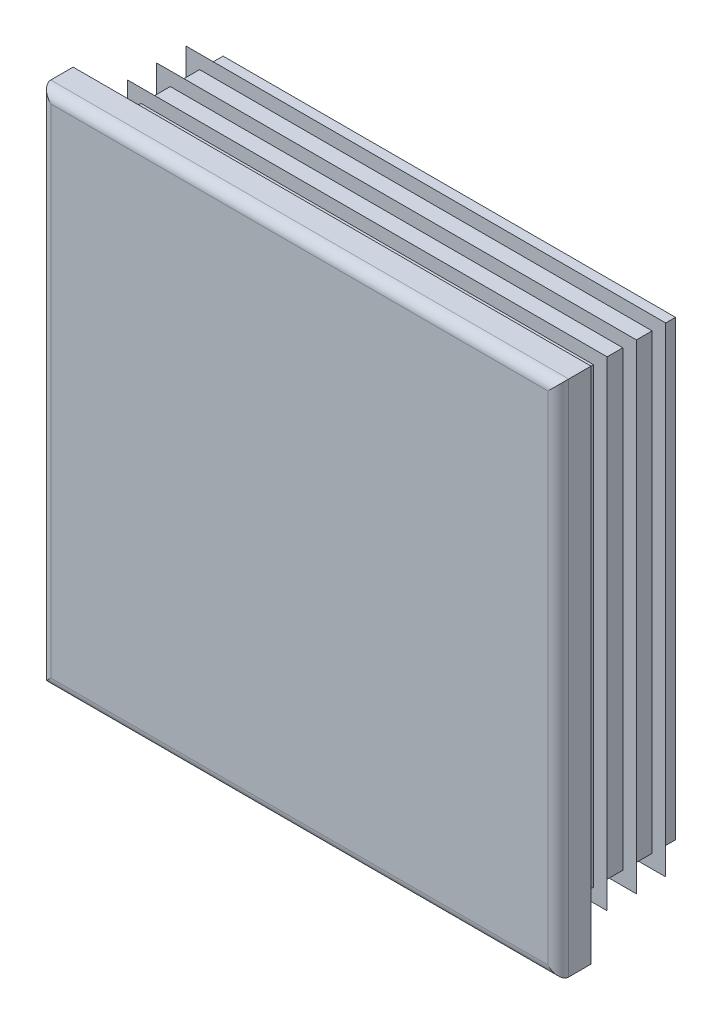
ISO-10303-21;
HEADER;
FILE_DESCRIPTION(('STEP AP214'),'2;1');
FILE_NAME('part.step','',(''),(''),'','','');
FILE_SCHEMA(('AUTOMOTIVE_DESIGN { 1 0 10303 214 1 1 1 1 }'));
ENDSEC;
DATA;
#1=APPLICATION_CONTEXT('core data for automotive mechanical design processes');
#2=APPLICATION_PROTOCOL_DEFINITION('international standard','automotive_design',2000,#1);
#3=PRODUCT_CONTEXT('',#1,'mechanical');
#4=PRODUCT('Part','Part','',(#3));
#5=PRODUCT_RELATED_PRODUCT_CATEGORY('part','',(#4));
#6=PRODUCT_DEFINITION_FORMATION('','',#4);
#7=PRODUCT_DEFINITION_CONTEXT('part definition',#1,'design');
#8=PRODUCT_DEFINITION('design','',#6,#7);
#9=PRODUCT_DEFINITION_SHAPE('','',#8);
#10=(LENGTH_UNIT() NAMED_UNIT(*) SI_UNIT(.MILLI.,.METRE.));
#11=(NAMED_UNIT(*) PLANE_ANGLE_UNIT() SI_UNIT($,.RADIAN.));
#12=(NAMED_UNIT(*) SI_UNIT($,.STERADIAN.) SOLID_ANGLE_UNIT());
#13=UNCERTAINTY_MEASURE_WITH_UNIT(LENGTH_MEASURE(1.E-05),#10,'distance_accuracy_value','');
#14=(GEOMETRIC_REPRESENTATION_CONTEXT(3) GLOBAL_UNCERTAINTY_ASSIGNED_CONTEXT((#13)) GLOBAL_UNIT_ASSIGNED_CONTEXT((#10,
#11,#12)) REPRESENTATION_CONTEXT('',''));
#15=CARTESIAN_POINT('',(0.,0.,0.));
#16=DIRECTION('',(0.,0.,1.));
#17=DIRECTION('',(1.,0.,0.));
#18=AXIS2_PLACEMENT_3D('',#15,#16,#17);
#19=CARTESIAN_POINT('',(45.6,-47.5,6.));
#20=DIRECTION('',(0.,0.,-1.));
#21=DIRECTION('',(0.,1.,0.));
#22=AXIS2_PLACEMENT_3D('',#19,#20,#21);
#23=PLANE('',#22);
#24=DIRECTION('',(0.,1.,0.));
#25=VECTOR('',#24,1.);
#26=CARTESIAN_POINT('',(-45.6,-47.5,6.));
#27=LINE('',#26,#25);
#28=CARTESIAN_POINT('',(-45.6,-45.6,6.));
#29=VERTEX_POINT('',#28);
#30=CARTESIAN_POINT('',(-45.6,45.6,6.));
#31=VERTEX_POINT('',#30);
#32=EDGE_CURVE('E262',#29,#31,#27,.T.);
#33=ORIENTED_EDGE('',*,*,#32,.F.);
#34=DIRECTION('',(-1.,0.,0.));
#35=VECTOR('',#34,1.);
#36=CARTESIAN_POINT('',(47.5,-45.6,6.));
#37=LINE('',#36,#35);
#38=CARTESIAN_POINT('',(45.6,-45.6,6.));
#39=VERTEX_POINT('',#38);
#40=EDGE_CURVE('E432',#39,#29,#37,.T.);
#41=ORIENTED_EDGE('',*,*,#40,.F.);
#42=DIRECTION('',(0.,1.,0.));
#43=VECTOR('',#42,1.);
#44=CARTESIAN_POINT('',(45.6,-47.5,6.));
#45=LINE('',#44,#43);
#46=CARTESIAN_POINT('',(45.6,45.6,6.));
#47=VERTEX_POINT('',#46);
#48=EDGE_CURVE('E257',#39,#47,#45,.T.);
#49=ORIENTED_EDGE('',*,*,#48,.T.);
#50=DIRECTION('',(-1.,0.,0.));
#51=VECTOR('',#50,1.);
#52=CARTESIAN_POINT('',(47.5,45.6,6.));
#53=LINE('',#52,#51);
#54=EDGE_CURVE('E534',#47,#31,#53,.T.);
#55=ORIENTED_EDGE('',*,*,#54,.T.);
#56=EDGE_LOOP('',(#33,#41,#49,#55));
#57=FACE_BOUND('',#56,.T.);
#58=ADVANCED_FACE('F14',(#57),#23,.F.);
#59=CARTESIAN_POINT('',(-45.6,-47.5,4.1));
#60=DIRECTION('',(0.,1.,0.));
#61=DIRECTION('',(-1.,0.,0.));
#62=AXIS2_PLACEMENT_3D('',#59,#60,#61);
#63=CYLINDRICAL_SURFACE('',#62,1.9);
#64=DIRECTION('',(0.,1.,0.));
#65=VECTOR('',#64,1.);
#66=CARTESIAN_POINT('',(-47.5,-47.5,4.1));
#67=LINE('',#66,#65);
#68=CARTESIAN_POINT('',(-47.5,-47.5,4.1));
#69=VERTEX_POINT('',#68);
#70=CARTESIAN_POINT('',(-47.5,47.5,4.1));
#71=VERTEX_POINT('',#70);
#72=EDGE_CURVE('E354',#69,#71,#67,.T.);
#73=ORIENTED_EDGE('',*,*,#72,.F.);
#74=CARTESIAN_POINT('',(-45.6,-45.6,4.1));
#75=DIRECTION('',(-0.707106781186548,0.707106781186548,0.));
#76=DIRECTION('',(0.707106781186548,0.707106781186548,0.));
#77=AXIS2_PLACEMENT_3D('',#74,#75,#76);
#78=ELLIPSE('',#77,2.68700576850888,1.9);
#79=EDGE_CURVE('E59',#69,#29,#78,.T.);
#80=ORIENTED_EDGE('',*,*,#79,.T.);
#81=ORIENTED_EDGE('',*,*,#32,.T.);
#82=CARTESIAN_POINT('',(-45.6,45.6,4.1));
#83=DIRECTION('',(0.707106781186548,0.707106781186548,0.));
#84=DIRECTION('',(-0.707106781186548,0.707106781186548,0.));
#85=AXIS2_PLACEMENT_3D('',#82,#83,#84);
#86=ELLIPSE('',#85,2.68700576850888,1.9);
#87=EDGE_CURVE('E258',#31,#71,#86,.F.);
#88=ORIENTED_EDGE('',*,*,#87,.T.);
#89=EDGE_LOOP('',(#73,#80,#81,#88));
#90=FACE_BOUND('',#89,.T.);
#91=ADVANCED_FACE('F16',(#90),#63,.T.);
#92=CARTESIAN_POINT('',(-47.5,-47.5,4.1));
#93=DIRECTION('',(1.,0.,0.));
#94=DIRECTION('',(0.,1.,0.));
#95=AXIS2_PLACEMENT_3D('',#92,#93,#94);
#96=PLANE('',#95);
#97=DIRECTION('',(0.,0.,-1.));
#98=VECTOR('',#97,1.);
#99=CARTESIAN_POINT('',(-47.5,47.5,4.1));
#100=LINE('',#99,#98);
#101=CARTESIAN_POINT('',(-47.5,47.5,0.));
#102=VERTEX_POINT('',#101);
#103=EDGE_CURVE('E519',#71,#102,#100,.T.);
#104=ORIENTED_EDGE('',*,*,#103,.T.);
#105=DIRECTION('',(0.,1.,0.));
#106=VECTOR('',#105,1.);
#107=CARTESIAN_POINT('',(-47.5,-47.5,0.));
#108=LINE('',#107,#106);
#109=CARTESIAN_POINT('',(-47.5,-47.5,0.));
#110=VERTEX_POINT('',#109);
#111=EDGE_CURVE('E352',#110,#102,#108,.T.);
#112=ORIENTED_EDGE('',*,*,#111,.F.);
#113=DIRECTION('',(0.,0.,-1.));
#114=VECTOR('',#113,1.);
#115=CARTESIAN_POINT('',(-47.5,-47.5,4.1));
#116=LINE('',#115,#114);
#117=EDGE_CURVE('E520',#69,#110,#116,.T.);
#118=ORIENTED_EDGE('',*,*,#117,.F.);
#119=ORIENTED_EDGE('',*,*,#72,.T.);
#120=EDGE_LOOP('',(#104,#112,#118,#119));
#121=FACE_BOUND('',#120,.T.);
#122=ADVANCED_FACE('F604',(#121),#96,.F.);
#123=CARTESIAN_POINT('',(-41.5,-47.5,0.));
#124=DIRECTION('',(1.,0.,0.));
#125=DIRECTION('',(0.,1.,0.));
#126=AXIS2_PLACEMENT_3D('',#123,#124,#125);
#127=PLANE('',#126);
#128=DIRECTION('',(0.,1.,0.));
#129=VECTOR('',#128,1.);
#130=CARTESIAN_POINT('',(-41.5,-47.5,0.));
#131=LINE('',#130,#129);
#132=CARTESIAN_POINT('',(-41.5,-41.5,0.));
#133=VERTEX_POINT('',#132);
#134=CARTESIAN_POINT('',(-41.5,41.5,0.));
#135=VERTEX_POINT('',#134);
#136=EDGE_CURVE('E349',#133,#135,#131,.T.);
#137=ORIENTED_EDGE('',*,*,#136,.T.);
#138=DIRECTION('',(0.,0.,-1.));
#139=VECTOR('',#138,1.);
#140=CARTESIAN_POINT('',(-41.5,41.5,0.));
#141=LINE('',#140,#139);
#142=CARTESIAN_POINT('',(-41.5,41.5,-1.075));
#143=VERTEX_POINT('',#142);
#144=EDGE_CURVE('E445',#135,#143,#141,.T.);
#145=ORIENTED_EDGE('',*,*,#144,.T.);
#146=DIRECTION('',(0.,1.,0.));
#147=VECTOR('',#146,1.);
#148=CARTESIAN_POINT('',(-41.5,-47.5,-1.075));
#149=LINE('',#148,#147);
#150=CARTESIAN_POINT('',(-41.5,-41.5,-1.075));
#151=VERTEX_POINT('',#150);
#152=EDGE_CURVE('E346',#151,#143,#149,.T.);
#153=ORIENTED_EDGE('',*,*,#152,.F.);
#154=DIRECTION('',(0.,0.,1.));
#155=VECTOR('',#154,1.);
#156=CARTESIAN_POINT('',(-41.5,-41.5,0.));
#157=LINE('',#156,#155);
#158=EDGE_CURVE('E439',#151,#133,#157,.T.);
#159=ORIENTED_EDGE('',*,*,#158,.T.);
#160=EDGE_LOOP('',(#137,#145,#153,#159));
#161=FACE_BOUND('',#160,.T.);
#162=ADVANCED_FACE('F728',(#161),#127,.F.);
#163=CARTESIAN_POINT('',(-44.,-47.5,-1.075));
#164=DIRECTION('',(0.573576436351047,0.,0.819152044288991));
#165=DIRECTION('',(-0.819152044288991,0.,0.573576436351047));
#166=AXIS2_PLACEMENT_3D('',#163,#164,#165);
#167=PLANE('',#166);
#168=DIRECTION('',(0.,1.,0.));
#169=VECTOR('',#168,1.);
#170=CARTESIAN_POINT('',(-44.,-47.5,-1.075));
#171=LINE('',#170,#169);
#172=CARTESIAN_POINT('',(-44.,-44.,-1.075));
#173=VERTEX_POINT('',#172);
#174=CARTESIAN_POINT('',(-44.,44.,-1.075));
#175=VERTEX_POINT('',#174);
#176=EDGE_CURVE('E344',#173,#175,#171,.T.);
#177=ORIENTED_EDGE('',*,*,#176,.T.);
#178=DIRECTION('',(0.633687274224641,-0.633687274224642,-0.443712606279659));
#179=VECTOR('',#178,1.);
#180=CARTESIAN_POINT('',(-7.25730012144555,7.25730012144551,-26.8025154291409));
#181=LINE('',#180,#179);
#182=CARTESIAN_POINT('',(-41.5,41.5,-2.82551884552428));
#183=VERTEX_POINT('',#182);
#184=EDGE_CURVE('E457',#175,#183,#181,.T.);
#185=ORIENTED_EDGE('',*,*,#184,.T.);
#186=DIRECTION('',(0.,1.,0.));
#187=VECTOR('',#186,1.);
#188=CARTESIAN_POINT('',(-41.5,-47.5,-2.82551884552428));
#189=LINE('',#188,#187);
#190=CARTESIAN_POINT('',(-41.5,-41.5,-2.82551884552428));
#191=VERTEX_POINT('',#190);
#192=EDGE_CURVE('E341',#191,#183,#189,.T.);
#193=ORIENTED_EDGE('',*,*,#192,.F.);
#194=DIRECTION('',(-0.633687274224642,-0.633687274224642,0.443712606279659));
#195=VECTOR('',#194,1.);
#196=CARTESIAN_POINT('',(-45.4054584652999,-45.4054584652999,-0.0908873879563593));
#197=LINE('',#196,#195);
#198=EDGE_CURVE('E451',#191,#173,#197,.T.);
#199=ORIENTED_EDGE('',*,*,#198,.T.);
#200=EDGE_LOOP('',(#177,#185,#193,#199));
#201=FACE_BOUND('',#200,.T.);
#202=ADVANCED_FACE('F732',(#201),#167,.F.);
#203=CARTESIAN_POINT('',(-41.5,-47.5,-2.82551884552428));
#204=DIRECTION('',(1.,0.,0.));
#205=DIRECTION('',(0.,1.,0.));
#206=AXIS2_PLACEMENT_3D('',#203,#204,#205);
#207=PLANE('',#206);
#208=ORIENTED_EDGE('',*,*,#192,.T.);
#209=DIRECTION('',(0.,0.,-1.));
#210=VECTOR('',#209,1.);
#211=CARTESIAN_POINT('',(-41.5,41.5,-2.82551884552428));
#212=LINE('',#211,#210);
#213=CARTESIAN_POINT('',(-41.5,41.5,-6.45));
#214=VERTEX_POINT('',#213);
#215=EDGE_CURVE('E463',#183,#214,#212,.T.);
#216=ORIENTED_EDGE('',*,*,#215,.T.);
#217=DIRECTION('',(0.,1.,0.));
#218=VECTOR('',#217,1.);
#219=CARTESIAN_POINT('',(-41.5,-47.5,-6.45));
#220=LINE('',#219,#218);
#221=CARTESIAN_POINT('',(-41.5,-41.5,-6.45));
#222=VERTEX_POINT('',#221);
#223=EDGE_CURVE('E338',#222,#214,#220,.T.);
#224=ORIENTED_EDGE('',*,*,#223,.F.);
#225=DIRECTION('',(0.,0.,1.));
#226=VECTOR('',#225,1.);
#227=CARTESIAN_POINT('',(-41.5,-41.5,-2.82551884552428));
#228=LINE('',#227,#226);
#229=EDGE_CURVE('E460',#222,#191,#228,.T.);
#230=ORIENTED_EDGE('',*,*,#229,.T.);
#231=EDGE_LOOP('',(#208,#216,#224,#230));
#232=FACE_BOUND('',#231,.T.);
#233=ADVANCED_FACE('F738',(#232),#207,.F.);
#234=CARTESIAN_POINT('',(-44.,-47.5,-6.45));
#235=DIRECTION('',(0.573576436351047,0.,0.819152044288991));
#236=DIRECTION('',(-0.819152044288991,0.,0.573576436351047));
#237=AXIS2_PLACEMENT_3D('',#234,#235,#236);
#238=PLANE('',#237);
#239=DIRECTION('',(0.,1.,0.));
#240=VECTOR('',#239,1.);
#241=CARTESIAN_POINT('',(-44.,-47.5,-6.45));
#242=LINE('',#241,#240);
#243=CARTESIAN_POINT('',(-44.,-44.,-6.45));
#244=VERTEX_POINT('',#243);
#245=CARTESIAN_POINT('',(-44.,44.,-6.45));
#246=VERTEX_POINT('',#245);
#247=EDGE_CURVE('E336',#244,#246,#242,.T.);
#248=ORIENTED_EDGE('',*,*,#247,.T.);
#249=DIRECTION('',(0.633687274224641,-0.633687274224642,-0.443712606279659));
#250=VECTOR('',#249,1.);
#251=CARTESIAN_POINT('',(-7.25730012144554,7.25730012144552,-32.1775154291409));
#252=LINE('',#251,#250);
#253=CARTESIAN_POINT('',(-41.5,41.5,-8.20051884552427));
#254=VERTEX_POINT('',#253);
#255=EDGE_CURVE('E475',#246,#254,#252,.T.);
#256=ORIENTED_EDGE('',*,*,#255,.T.);
#257=DIRECTION('',(0.,1.,0.));
#258=VECTOR('',#257,1.);
#259=CARTESIAN_POINT('',(-41.5,-47.5,-8.20051884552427));
#260=LINE('',#259,#258);
#261=CARTESIAN_POINT('',(-41.5,-41.5,-8.20051884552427));
#262=VERTEX_POINT('',#261);
#263=EDGE_CURVE('E333',#262,#254,#260,.T.);
#264=ORIENTED_EDGE('',*,*,#263,.F.);
#265=DIRECTION('',(-0.633687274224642,-0.633687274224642,0.443712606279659));
#266=VECTOR('',#265,1.);
#267=CARTESIAN_POINT('',(-45.4054584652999,-45.4054584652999,-5.46588738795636));
#268=LINE('',#267,#266);
#269=EDGE_CURVE('E469',#262,#244,#268,.T.);
#270=ORIENTED_EDGE('',*,*,#269,.T.);
#271=EDGE_LOOP('',(#248,#256,#264,#270));
#272=FACE_BOUND('',#271,.T.);
#273=ADVANCED_FACE('F742',(#272),#238,.F.);
#274=CARTESIAN_POINT('',(-41.5,-47.5,-8.20051884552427));
#275=DIRECTION('',(1.,0.,0.));
#276=DIRECTION('',(0.,1.,0.));
#277=AXIS2_PLACEMENT_3D('',#274,#275,#276);
#278=PLANE('',#277);
#279=ORIENTED_EDGE('',*,*,#263,.T.);
#280=DIRECTION('',(0.,0.,-1.));
#281=VECTOR('',#280,1.);
#282=CARTESIAN_POINT('',(-41.5,41.5,-8.20051884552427));
#283=LINE('',#282,#281);
#284=CARTESIAN_POINT('',(-41.5,41.5,-11.825));
#285=VERTEX_POINT('',#284);
#286=EDGE_CURVE('E481',#254,#285,#283,.T.);
#287=ORIENTED_EDGE('',*,*,#286,.T.);
#288=DIRECTION('',(0.,1.,0.));
#289=VECTOR('',#288,1.);
#290=CARTESIAN_POINT('',(-41.5,-47.5,-11.825));
#291=LINE('',#290,#289);
#292=CARTESIAN_POINT('',(-41.5,-41.5,-11.825));
#293=VERTEX_POINT('',#292);
#294=EDGE_CURVE('E330',#293,#285,#291,.T.);
#295=ORIENTED_EDGE('',*,*,#294,.F.);
#296=DIRECTION('',(0.,0.,1.));
#297=VECTOR('',#296,1.);
#298=CARTESIAN_POINT('',(-41.5,-41.5,-8.20051884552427));
#299=LINE('',#298,#297);
#300=EDGE_CURVE('E478',#293,#262,#299,.T.);
#301=ORIENTED_EDGE('',*,*,#300,.T.);
#302=EDGE_LOOP('',(#279,#287,#295,#301));
#303=FACE_BOUND('',#302,.T.);
#304=ADVANCED_FACE('F746',(#303),#278,.F.);
#305=CARTESIAN_POINT('',(-44.,-47.5,-11.825));
#306=DIRECTION('',(0.573576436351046,0.,0.819152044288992));
#307=DIRECTION('',(-0.819152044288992,0.,0.573576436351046));
#308=AXIS2_PLACEMENT_3D('',#305,#306,#307);
#309=PLANE('',#308);
#310=DIRECTION('',(0.,1.,0.));
#311=VECTOR('',#310,1.);
#312=CARTESIAN_POINT('',(-44.,-47.5,-11.825));
#313=LINE('',#312,#311);
#314=CARTESIAN_POINT('',(-44.,-44.,-11.825));
#315=VERTEX_POINT('',#314);
#316=CARTESIAN_POINT('',(-44.,44.,-11.825));
#317=VERTEX_POINT('',#316);
#318=EDGE_CURVE('E328',#315,#317,#313,.T.);
#319=ORIENTED_EDGE('',*,*,#318,.T.);
#320=DIRECTION('',(0.633687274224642,-0.633687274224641,-0.443712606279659));
#321=VECTOR('',#320,1.);
#322=CARTESIAN_POINT('',(-7.25730012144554,7.2573001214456,-37.5525154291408));
#323=LINE('',#322,#321);
#324=CARTESIAN_POINT('',(-41.5,41.5,-13.5755188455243));
#325=VERTEX_POINT('',#324);
#326=EDGE_CURVE('E493',#317,#325,#323,.T.);
#327=ORIENTED_EDGE('',*,*,#326,.T.);
#328=DIRECTION('',(0.,1.,0.));
#329=VECTOR('',#328,1.);
#330=CARTESIAN_POINT('',(-41.5,-47.5,-13.5755188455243));
#331=LINE('',#330,#329);
#332=CARTESIAN_POINT('',(-41.5,-41.5,-13.5755188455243));
#333=VERTEX_POINT('',#332);
#334=EDGE_CURVE('E325',#333,#325,#331,.T.);
#335=ORIENTED_EDGE('',*,*,#334,.F.);
#336=DIRECTION('',(-0.633687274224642,-0.633687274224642,0.443712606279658));
#337=VECTOR('',#336,1.);
#338=CARTESIAN_POINT('',(-45.4054584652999,-45.4054584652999,-10.8408873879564));
#339=LINE('',#338,#337);
#340=EDGE_CURVE('E487',#333,#315,#339,.T.);
#341=ORIENTED_EDGE('',*,*,#340,.T.);
#342=EDGE_LOOP('',(#319,#327,#335,#341));
#343=FACE_BOUND('',#342,.T.);
#344=ADVANCED_FACE('F668',(#343),#309,.F.);
#345=CARTESIAN_POINT('',(-41.5,-47.5,-13.5755188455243));
#346=DIRECTION('',(1.,0.,0.));
#347=DIRECTION('',(0.,1.,0.));
#348=AXIS2_PLACEMENT_3D('',#345,#346,#347);
#349=PLANE('',#348);
#350=ORIENTED_EDGE('',*,*,#334,.T.);
#351=DIRECTION('',(0.,0.,-1.));
#352=VECTOR('',#351,1.);
#353=CARTESIAN_POINT('',(-41.5,41.5,-13.5755188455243));
#354=LINE('',#353,#352);
#355=CARTESIAN_POINT('',(-41.5,41.5,-17.2));
#356=VERTEX_POINT('',#355);
#357=EDGE_CURVE('E499',#325,#356,#354,.T.);
#358=ORIENTED_EDGE('',*,*,#357,.T.);
#359=DIRECTION('',(0.,1.,0.));
#360=VECTOR('',#359,1.);
#361=CARTESIAN_POINT('',(-41.5,-47.5,-17.2));
#362=LINE('',#361,#360);
#363=CARTESIAN_POINT('',(-41.5,-41.5,-17.2));
#364=VERTEX_POINT('',#363);
#365=EDGE_CURVE('E322',#364,#356,#362,.T.);
#366=ORIENTED_EDGE('',*,*,#365,.F.);
#367=DIRECTION('',(0.,0.,1.));
#368=VECTOR('',#367,1.);
#369=CARTESIAN_POINT('',(-41.5,-41.5,-13.5755188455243));
#370=LINE('',#369,#368);
#371=EDGE_CURVE('E496',#364,#333,#370,.T.);
#372=ORIENTED_EDGE('',*,*,#371,.T.);
#373=EDGE_LOOP('',(#350,#358,#366,#372));
#374=FACE_BOUND('',#373,.T.);
#375=ADVANCED_FACE('F665',(#374),#349,.F.);
#376=CARTESIAN_POINT('',(-44.,-47.5,-17.2));
#377=DIRECTION('',(0.573576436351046,0.,0.819152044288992));
#378=DIRECTION('',(-0.819152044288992,0.,0.573576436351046));
#379=AXIS2_PLACEMENT_3D('',#376,#377,#378);
#380=PLANE('',#379);
#381=DIRECTION('',(0.,1.,0.));
#382=VECTOR('',#381,1.);
#383=CARTESIAN_POINT('',(-44.,-47.5,-17.2));
#384=LINE('',#383,#382);
#385=CARTESIAN_POINT('',(-44.,-44.,-17.2));
#386=VERTEX_POINT('',#385);
#387=CARTESIAN_POINT('',(-44.,44.,-17.2));
#388=VERTEX_POINT('',#387);
#389=EDGE_CURVE('E320',#386,#388,#384,.T.);
#390=ORIENTED_EDGE('',*,*,#389,.T.);
#391=DIRECTION('',(0.633687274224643,-0.633687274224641,-0.443712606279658));
#392=VECTOR('',#391,1.);
#393=CARTESIAN_POINT('',(-7.25730012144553,7.25730012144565,-42.9275154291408));
#394=LINE('',#393,#392);
#395=CARTESIAN_POINT('',(-41.5,41.5,-18.9505188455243));
#396=VERTEX_POINT('',#395);
#397=EDGE_CURVE('E511',#388,#396,#394,.T.);
#398=ORIENTED_EDGE('',*,*,#397,.T.);
#399=DIRECTION('',(0.,1.,0.));
#400=VECTOR('',#399,1.);
#401=CARTESIAN_POINT('',(-41.5,-47.5,-18.9505188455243));
#402=LINE('',#401,#400);
#403=CARTESIAN_POINT('',(-41.5,-41.5,-18.9505188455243));
#404=VERTEX_POINT('',#403);
#405=EDGE_CURVE('E317',#404,#396,#402,.T.);
#406=ORIENTED_EDGE('',*,*,#405,.F.);
#407=DIRECTION('',(-0.633687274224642,-0.633687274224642,0.443712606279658));
#408=VECTOR('',#407,1.);
#409=CARTESIAN_POINT('',(-45.4054584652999,-45.4054584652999,-16.2158873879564));
#410=LINE('',#409,#408);
#411=EDGE_CURVE('E505',#404,#386,#410,.T.);
#412=ORIENTED_EDGE('',*,*,#411,.T.);
#413=EDGE_LOOP('',(#390,#398,#406,#412));
#414=FACE_BOUND('',#413,.T.);
#415=ADVANCED_FACE('F580',(#414),#380,.F.);
#416=CARTESIAN_POINT('',(-41.5,-47.5,-18.9505188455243));
#417=DIRECTION('',(1.,0.,0.));
#418=DIRECTION('',(0.,1.,0.));
#419=AXIS2_PLACEMENT_3D('',#416,#417,#418);
#420=PLANE('',#419);
#421=ORIENTED_EDGE('',*,*,#405,.T.);
#422=DIRECTION('',(0.,0.,-1.));
#423=VECTOR('',#422,1.);
#424=CARTESIAN_POINT('',(-41.5,41.5,-18.9505188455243));
#425=LINE('',#424,#423);
#426=CARTESIAN_POINT('',(-41.5,41.5,-21.5));
#427=VERTEX_POINT('',#426);
#428=EDGE_CURVE('E517',#396,#427,#425,.T.);
#429=ORIENTED_EDGE('',*,*,#428,.T.);
#430=DIRECTION('',(0.,1.,0.));
#431=VECTOR('',#430,1.);
#432=CARTESIAN_POINT('',(-41.5,-47.5,-21.5));
#433=LINE('',#432,#431);
#434=CARTESIAN_POINT('',(-41.5,-41.5,-21.5));
#435=VERTEX_POINT('',#434);
#436=EDGE_CURVE('E314',#435,#427,#433,.T.);
#437=ORIENTED_EDGE('',*,*,#436,.F.);
#438=DIRECTION('',(0.,0.,1.));
#439=VECTOR('',#438,1.);
#440=CARTESIAN_POINT('',(-41.5,-41.5,-18.9505188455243));
#441=LINE('',#440,#439);
#442=EDGE_CURVE('E514',#435,#404,#441,.T.);
#443=ORIENTED_EDGE('',*,*,#442,.T.);
#444=EDGE_LOOP('',(#421,#429,#437,#443));
#445=FACE_BOUND('',#444,.T.);
#446=ADVANCED_FACE('F582',(#445),#420,.F.);
#447=CARTESIAN_POINT('',(-41.5,-47.5,-21.5));
#448=DIRECTION('',(0.,0.,1.));
#449=DIRECTION('',(0.,-1.,0.));
#450=AXIS2_PLACEMENT_3D('',#447,#448,#449);
#451=PLANE('',#450);
#452=ORIENTED_EDGE('',*,*,#436,.T.);
#453=DIRECTION('',(-1.,0.,0.));
#454=VECTOR('',#453,1.);
#455=CARTESIAN_POINT('',(47.5,41.5,-21.5));
#456=LINE('',#455,#454);
#457=CARTESIAN_POINT('',(41.5,41.5,-21.5));
#458=VERTEX_POINT('',#457);
#459=EDGE_CURVE('E388',#458,#427,#456,.T.);
#460=ORIENTED_EDGE('',*,*,#459,.F.);
#461=DIRECTION('',(0.,1.,0.));
#462=VECTOR('',#461,1.);
#463=CARTESIAN_POINT('',(41.5,-47.5,-21.5));
#464=LINE('',#463,#462);
#465=CARTESIAN_POINT('',(41.5,-41.5,-21.5));
#466=VERTEX_POINT('',#465);
#467=EDGE_CURVE('E311',#466,#458,#464,.T.);
#468=ORIENTED_EDGE('',*,*,#467,.F.);
#469=DIRECTION('',(-1.,0.,0.));
#470=VECTOR('',#469,1.);
#471=CARTESIAN_POINT('',(47.5,-41.5,-21.5));
#472=LINE('',#471,#470);
#473=EDGE_CURVE('E386',#466,#435,#472,.T.);
#474=ORIENTED_EDGE('',*,*,#473,.T.);
#475=EDGE_LOOP('',(#452,#460,#468,#474));
#476=FACE_BOUND('',#475,.T.);
#477=ADVANCED_FACE('F385',(#476),#451,.F.);
#478=CARTESIAN_POINT('',(41.5,-47.5,-21.5));
#479=DIRECTION('',(-1.,0.,0.));
#480=DIRECTION('',(0.,-1.,0.));
#481=AXIS2_PLACEMENT_3D('',#478,#479,#480);
#482=PLANE('',#481);
#483=ORIENTED_EDGE('',*,*,#467,.T.);
#484=DIRECTION('',(0.,0.,1.));
#485=VECTOR('',#484,1.);
#486=CARTESIAN_POINT('',(41.5,41.5,-21.5));
#487=LINE('',#486,#485);
#488=CARTESIAN_POINT('',(41.5,41.5,-18.9505188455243));
#489=VERTEX_POINT('',#488);
#490=EDGE_CURVE('E9',#458,#489,#487,.T.);
#491=ORIENTED_EDGE('',*,*,#490,.T.);
#492=DIRECTION('',(0.,1.,0.));
#493=VECTOR('',#492,1.);
#494=CARTESIAN_POINT('',(41.5,-47.5,-18.9505188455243));
#495=LINE('',#494,#493);
#496=CARTESIAN_POINT('',(41.5,-41.5,-18.9505188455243));
#497=VERTEX_POINT('',#496);
#498=EDGE_CURVE('E308',#497,#489,#495,.T.);
#499=ORIENTED_EDGE('',*,*,#498,.F.);
#500=DIRECTION('',(0.,0.,-1.));
#501=VECTOR('',#500,1.);
#502=CARTESIAN_POINT('',(41.5,-41.5,-21.5));
#503=LINE('',#502,#501);
#504=EDGE_CURVE('E23',#497,#466,#503,.T.);
#505=ORIENTED_EDGE('',*,*,#504,.T.);
#506=EDGE_LOOP('',(#483,#491,#499,#505));
#507=FACE_BOUND('',#506,.T.);
#508=ADVANCED_FACE('F378',(#507),#482,.F.);
#509=CARTESIAN_POINT('',(41.5,-47.5,-18.9505188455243));
#510=DIRECTION('',(-0.573576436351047,0.,0.819152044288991));
#511=DIRECTION('',(-0.819152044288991,0.,-0.573576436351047));
#512=AXIS2_PLACEMENT_3D('',#509,#510,#511);
#513=PLANE('',#512);
#514=ORIENTED_EDGE('',*,*,#498,.T.);
#515=DIRECTION('',(0.633687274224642,0.633687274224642,0.443712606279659));
#516=VECTOR('',#515,1.);
#517=CARTESIAN_POINT('',(5.76119902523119,5.76119902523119,-43.975096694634));
#518=LINE('',#517,#516);
#519=CARTESIAN_POINT('',(44.,44.,-17.2));
#520=VERTEX_POINT('',#519);
#521=EDGE_CURVE('E508',#489,#520,#518,.T.);
#522=ORIENTED_EDGE('',*,*,#521,.T.);
#523=DIRECTION('',(0.,1.,0.));
#524=VECTOR('',#523,1.);
#525=CARTESIAN_POINT('',(44.,-47.5,-17.2));
#526=LINE('',#525,#524);
#527=CARTESIAN_POINT('',(44.,-44.,-17.2));
#528=VERTEX_POINT('',#527);
#529=EDGE_CURVE('E305',#528,#520,#526,.T.);
#530=ORIENTED_EDGE('',*,*,#529,.F.);
#531=DIRECTION('',(-0.633687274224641,0.633687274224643,-0.443712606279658));
#532=VECTOR('',#531,1.);
#533=CARTESIAN_POINT('',(43.9093573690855,-43.9093573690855,-17.2634686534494));
#534=LINE('',#533,#532);
#535=EDGE_CURVE('E502',#528,#497,#534,.T.);
#536=ORIENTED_EDGE('',*,*,#535,.T.);
#537=EDGE_LOOP('',(#514,#522,#530,#536));
#538=FACE_BOUND('',#537,.T.);
#539=ADVANCED_FACE('F588',(#538),#513,.F.);
#540=CARTESIAN_POINT('',(44.,-47.5,-17.2));
#541=DIRECTION('',(0.,0.,-1.));
#542=DIRECTION('',(0.,1.,0.));
#543=AXIS2_PLACEMENT_3D('',#540,#541,#542);
#544=PLANE('',#543);
#545=ORIENTED_EDGE('',*,*,#529,.T.);
#546=DIRECTION('',(-1.,0.,0.));
#547=VECTOR('',#546,1.);
#548=CARTESIAN_POINT('',(47.5,44.,-17.2));
#549=LINE('',#548,#547);
#550=EDGE_CURVE('E394',#520,#388,#549,.T.);
#551=ORIENTED_EDGE('',*,*,#550,.T.);
#552=ORIENTED_EDGE('',*,*,#389,.F.);
#553=DIRECTION('',(-1.,0.,0.));
#554=VECTOR('',#553,1.);
#555=CARTESIAN_POINT('',(47.5,-44.,-17.2));
#556=LINE('',#555,#554);
#557=EDGE_CURVE('E401',#528,#386,#556,.T.);
#558=ORIENTED_EDGE('',*,*,#557,.F.);
#559=EDGE_LOOP('',(#545,#551,#552,#558));
#560=FACE_BOUND('',#559,.T.);
#561=ORIENTED_EDGE('',*,*,#365,.T.);
#562=DIRECTION('',(-1.,0.,0.));
#563=VECTOR('',#562,1.);
#564=CARTESIAN_POINT('',(47.5,41.5,-17.2));
#565=LINE('',#564,#563);
#566=CARTESIAN_POINT('',(41.5,41.5,-17.2));
#567=VERTEX_POINT('',#566);
#568=EDGE_CURVE('E567',#567,#356,#565,.T.);
#569=ORIENTED_EDGE('',*,*,#568,.F.);
#570=DIRECTION('',(0.,1.,0.));
#571=VECTOR('',#570,1.);
#572=CARTESIAN_POINT('',(41.5,-47.5,-17.2));
#573=LINE('',#572,#571);
#574=CARTESIAN_POINT('',(41.5,-41.5,-17.2));
#575=VERTEX_POINT('',#574);
#576=EDGE_CURVE('E302',#575,#567,#573,.T.);
#577=ORIENTED_EDGE('',*,*,#576,.F.);
#578=DIRECTION('',(-1.,0.,0.));
#579=VECTOR('',#578,1.);
#580=CARTESIAN_POINT('',(47.5,-41.5,-17.2));
#581=LINE('',#580,#579);
#582=EDGE_CURVE('E403',#575,#364,#581,.T.);
#583=ORIENTED_EDGE('',*,*,#582,.T.);
#584=EDGE_LOOP('',(#561,#569,#577,#583));
#585=FACE_BOUND('',#584,.T.);
#586=ADVANCED_FACE('F571',(#560,#585),#544,.F.);
#587=CARTESIAN_POINT('',(41.5,-47.5,-17.2));
#588=DIRECTION('',(-1.,0.,0.));
#589=DIRECTION('',(0.,-1.,0.));
#590=AXIS2_PLACEMENT_3D('',#587,#588,#589);
#591=PLANE('',#590);
#592=ORIENTED_EDGE('',*,*,#576,.T.);
#593=DIRECTION('',(0.,0.,1.));
#594=VECTOR('',#593,1.);
#595=CARTESIAN_POINT('',(41.5,41.5,-17.2));
#596=LINE('',#595,#594);
#597=CARTESIAN_POINT('',(41.5,41.5,-13.5755188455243));
#598=VERTEX_POINT('',#597);
#599=EDGE_CURVE('E372',#567,#598,#596,.T.);
#600=ORIENTED_EDGE('',*,*,#599,.T.);
#601=DIRECTION('',(0.,1.,0.));
#602=VECTOR('',#601,1.);
#603=CARTESIAN_POINT('',(41.5,-47.5,-13.5755188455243));
#604=LINE('',#603,#602);
#605=CARTESIAN_POINT('',(41.5,-41.5,-13.5755188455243));
#606=VERTEX_POINT('',#605);
#607=EDGE_CURVE('E299',#606,#598,#604,.T.);
#608=ORIENTED_EDGE('',*,*,#607,.F.);
#609=DIRECTION('',(0.,0.,-1.));
#610=VECTOR('',#609,1.);
#611=CARTESIAN_POINT('',(41.5,-41.5,-17.2));
#612=LINE('',#611,#610);
#613=EDGE_CURVE('E369',#606,#575,#612,.T.);
#614=ORIENTED_EDGE('',*,*,#613,.T.);
#615=EDGE_LOOP('',(#592,#600,#608,#614));
#616=FACE_BOUND('',#615,.T.);
#617=ADVANCED_FACE('F596',(#616),#591,.F.);
#618=CARTESIAN_POINT('',(41.5,-47.5,-13.5755188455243));
#619=DIRECTION('',(-0.573576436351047,0.,0.819152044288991));
#620=DIRECTION('',(-0.819152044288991,0.,-0.573576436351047));
#621=AXIS2_PLACEMENT_3D('',#618,#619,#620);
#622=PLANE('',#621);
#623=ORIENTED_EDGE('',*,*,#607,.T.);
#624=DIRECTION('',(0.633687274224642,0.633687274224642,0.443712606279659));
#625=VECTOR('',#624,1.);
#626=CARTESIAN_POINT('',(5.76119902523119,5.76119902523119,-38.600096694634));
#627=LINE('',#626,#625);
#628=CARTESIAN_POINT('',(44.,44.,-11.825));
#629=VERTEX_POINT('',#628);
#630=EDGE_CURVE('E490',#598,#629,#627,.T.);
#631=ORIENTED_EDGE('',*,*,#630,.T.);
#632=DIRECTION('',(0.,1.,0.));
#633=VECTOR('',#632,1.);
#634=CARTESIAN_POINT('',(44.,-47.5,-11.825));
#635=LINE('',#634,#633);
#636=CARTESIAN_POINT('',(44.,-44.,-11.825));
#637=VERTEX_POINT('',#636);
#638=EDGE_CURVE('E296',#637,#629,#635,.T.);
#639=ORIENTED_EDGE('',*,*,#638,.F.);
#640=DIRECTION('',(-0.633687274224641,0.633687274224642,-0.443712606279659));
#641=VECTOR('',#640,1.);
#642=CARTESIAN_POINT('',(43.9093573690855,-43.9093573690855,-11.8884686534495));
#643=LINE('',#642,#641);
#644=EDGE_CURVE('E484',#637,#606,#643,.T.);
#645=ORIENTED_EDGE('',*,*,#644,.T.);
#646=EDGE_LOOP('',(#623,#631,#639,#645));
#647=FACE_BOUND('',#646,.T.);
#648=ADVANCED_FACE('F648',(#647),#622,.F.);
#649=CARTESIAN_POINT('',(44.,-47.5,-11.825));
#650=DIRECTION('',(0.,0.,-1.));
#651=DIRECTION('',(0.,1.,0.));
#652=AXIS2_PLACEMENT_3D('',#649,#650,#651);
#653=PLANE('',#652);
#654=ORIENTED_EDGE('',*,*,#638,.T.);
#655=DIRECTION('',(-1.,0.,0.));
#656=VECTOR('',#655,1.);
#657=CARTESIAN_POINT('',(47.5,44.,-11.825));
#658=LINE('',#657,#656);
#659=EDGE_CURVE('E561',#629,#317,#658,.T.);
#660=ORIENTED_EDGE('',*,*,#659,.T.);
#661=ORIENTED_EDGE('',*,*,#318,.F.);
#662=DIRECTION('',(-1.,0.,0.));
#663=VECTOR('',#662,1.);
#664=CARTESIAN_POINT('',(47.5,-44.,-11.825));
#665=LINE('',#664,#663);
#666=EDGE_CURVE('E409',#637,#315,#665,.T.);
#667=ORIENTED_EDGE('',*,*,#666,.F.);
#668=EDGE_LOOP('',(#654,#660,#661,#667));
#669=FACE_BOUND('',#668,.T.);
#670=ORIENTED_EDGE('',*,*,#294,.T.);
#671=DIRECTION('',(-1.,0.,0.));
#672=VECTOR('',#671,1.);
#673=CARTESIAN_POINT('',(47.5,41.5,-11.825));
#674=LINE('',#673,#672);
#675=CARTESIAN_POINT('',(41.5,41.5,-11.825));
#676=VERTEX_POINT('',#675);
#677=EDGE_CURVE('E559',#676,#285,#674,.T.);
#678=ORIENTED_EDGE('',*,*,#677,.F.);
#679=DIRECTION('',(0.,1.,0.));
#680=VECTOR('',#679,1.);
#681=CARTESIAN_POINT('',(41.5,-47.5,-11.825));
#682=LINE('',#681,#680);
#683=CARTESIAN_POINT('',(41.5,-41.5,-11.825));
#684=VERTEX_POINT('',#683);
#685=EDGE_CURVE('E293',#684,#676,#682,.T.);
#686=ORIENTED_EDGE('',*,*,#685,.F.);
#687=DIRECTION('',(-1.,0.,0.));
#688=VECTOR('',#687,1.);
#689=CARTESIAN_POINT('',(47.5,-41.5,-11.825));
#690=LINE('',#689,#688);
#691=EDGE_CURVE('E411',#684,#293,#690,.T.);
#692=ORIENTED_EDGE('',*,*,#691,.T.);
#693=EDGE_LOOP('',(#670,#678,#686,#692));
#694=FACE_BOUND('',#693,.T.);
#695=ADVANCED_FACE('F644',(#669,#694),#653,.F.);
#696=CARTESIAN_POINT('',(41.5,-47.5,-11.825));
#697=DIRECTION('',(-1.,0.,0.));
#698=DIRECTION('',(0.,-1.,0.));
#699=AXIS2_PLACEMENT_3D('',#696,#697,#698);
#700=PLANE('',#699);
#701=ORIENTED_EDGE('',*,*,#685,.T.);
#702=DIRECTION('',(0.,0.,1.));
#703=VECTOR('',#702,1.);
#704=CARTESIAN_POINT('',(41.5,41.5,-11.825));
#705=LINE('',#704,#703);
#706=CARTESIAN_POINT('',(41.5,41.5,-8.20051884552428));
#707=VERTEX_POINT('',#706);
#708=EDGE_CURVE('E366',#676,#707,#705,.T.);
#709=ORIENTED_EDGE('',*,*,#708,.T.);
#710=DIRECTION('',(0.,1.,0.));
#711=VECTOR('',#710,1.);
#712=CARTESIAN_POINT('',(41.5,-47.5,-8.20051884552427));
#713=LINE('',#712,#711);
#714=CARTESIAN_POINT('',(41.5,-41.5,-8.20051884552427));
#715=VERTEX_POINT('',#714);
#716=EDGE_CURVE('E290',#715,#707,#713,.T.);
#717=ORIENTED_EDGE('',*,*,#716,.F.);
#718=DIRECTION('',(0.,0.,-1.));
#719=VECTOR('',#718,1.);
#720=CARTESIAN_POINT('',(41.5,-41.5,-11.825));
#721=LINE('',#720,#719);
#722=EDGE_CURVE('E363',#715,#684,#721,.T.);
#723=ORIENTED_EDGE('',*,*,#722,.T.);
#724=EDGE_LOOP('',(#701,#709,#717,#723));
#725=FACE_BOUND('',#724,.T.);
#726=ADVANCED_FACE('F640',(#725),#700,.F.);
#727=CARTESIAN_POINT('',(41.5,-47.5,-8.20051884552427));
#728=DIRECTION('',(-0.573576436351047,0.,0.819152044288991));
#729=DIRECTION('',(-0.819152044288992,0.,-0.573576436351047));
#730=AXIS2_PLACEMENT_3D('',#727,#728,#729);
#731=PLANE('',#730);
#732=ORIENTED_EDGE('',*,*,#716,.T.);
#733=DIRECTION('',(0.633687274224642,0.633687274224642,0.443712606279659));
#734=VECTOR('',#733,1.);
#735=CARTESIAN_POINT('',(5.76119902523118,5.76119902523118,-33.2250966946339));
#736=LINE('',#735,#734);
#737=CARTESIAN_POINT('',(44.,44.,-6.45));
#738=VERTEX_POINT('',#737);
#739=EDGE_CURVE('E472',#707,#738,#736,.T.);
#740=ORIENTED_EDGE('',*,*,#739,.T.);
#741=DIRECTION('',(0.,1.,0.));
#742=VECTOR('',#741,1.);
#743=CARTESIAN_POINT('',(44.,-47.5,-6.45));
#744=LINE('',#743,#742);
#745=CARTESIAN_POINT('',(44.,-44.,-6.45));
#746=VERTEX_POINT('',#745);
#747=EDGE_CURVE('E287',#746,#738,#744,.T.);
#748=ORIENTED_EDGE('',*,*,#747,.F.);
#749=DIRECTION('',(-0.633687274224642,0.633687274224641,-0.443712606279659));
#750=VECTOR('',#749,1.);
#751=CARTESIAN_POINT('',(43.9093573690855,-43.9093573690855,-6.51346865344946));
#752=LINE('',#751,#750);
#753=EDGE_CURVE('E466',#746,#715,#752,.T.);
#754=ORIENTED_EDGE('',*,*,#753,.T.);
#755=EDGE_LOOP('',(#732,#740,#748,#754));
#756=FACE_BOUND('',#755,.T.);
#757=ADVANCED_FACE('F636',(#756),#731,.F.);
#758=CARTESIAN_POINT('',(44.,-47.5,-6.45));
#759=DIRECTION('',(0.,0.,-1.));
#760=DIRECTION('',(0.,1.,0.));
#761=AXIS2_PLACEMENT_3D('',#758,#759,#760);
#762=PLANE('',#761);
#763=ORIENTED_EDGE('',*,*,#747,.T.);
#764=DIRECTION('',(-1.,0.,0.));
#765=VECTOR('',#764,1.);
#766=CARTESIAN_POINT('',(47.5,44.,-6.45));
#767=LINE('',#766,#765);
#768=EDGE_CURVE('E553',#738,#246,#767,.T.);
#769=ORIENTED_EDGE('',*,*,#768,.T.);
#770=ORIENTED_EDGE('',*,*,#247,.F.);
#771=DIRECTION('',(-1.,0.,0.));
#772=VECTOR('',#771,1.);
#773=CARTESIAN_POINT('',(47.5,-44.,-6.45));
#774=LINE('',#773,#772);
#775=EDGE_CURVE('E417',#746,#244,#774,.T.);
#776=ORIENTED_EDGE('',*,*,#775,.F.);
#777=EDGE_LOOP('',(#763,#769,#770,#776));
#778=FACE_BOUND('',#777,.T.);
#779=ORIENTED_EDGE('',*,*,#223,.T.);
#780=DIRECTION('',(-1.,0.,0.));
#781=VECTOR('',#780,1.);
#782=CARTESIAN_POINT('',(47.5,41.5,-6.45));
#783=LINE('',#782,#781);
#784=CARTESIAN_POINT('',(41.5,41.5,-6.45));
#785=VERTEX_POINT('',#784);
#786=EDGE_CURVE('E551',#785,#214,#783,.T.);
#787=ORIENTED_EDGE('',*,*,#786,.F.);
#788=DIRECTION('',(0.,1.,0.));
#789=VECTOR('',#788,1.);
#790=CARTESIAN_POINT('',(41.5,-47.5,-6.45));
#791=LINE('',#790,#789);
#792=CARTESIAN_POINT('',(41.5,-41.5,-6.45));
#793=VERTEX_POINT('',#792);
#794=EDGE_CURVE('E284',#793,#785,#791,.T.);
#795=ORIENTED_EDGE('',*,*,#794,.F.);
#796=DIRECTION('',(-1.,0.,0.));
#797=VECTOR('',#796,1.);
#798=CARTESIAN_POINT('',(47.5,-41.5,-6.45));
#799=LINE('',#798,#797);
#800=EDGE_CURVE('E419',#793,#222,#799,.T.);
#801=ORIENTED_EDGE('',*,*,#800,.T.);
#802=EDGE_LOOP('',(#779,#787,#795,#801));
#803=FACE_BOUND('',#802,.T.);
#804=ADVANCED_FACE('F632',(#778,#803),#762,.F.);
#805=CARTESIAN_POINT('',(41.5,-47.5,-6.45));
#806=DIRECTION('',(-1.,0.,0.));
#807=DIRECTION('',(0.,-1.,0.));
#808=AXIS2_PLACEMENT_3D('',#805,#806,#807);
#809=PLANE('',#808);
#810=ORIENTED_EDGE('',*,*,#794,.T.);
#811=DIRECTION('',(0.,0.,1.));
#812=VECTOR('',#811,1.);
#813=CARTESIAN_POINT('',(41.5,41.5,-6.45));
#814=LINE('',#813,#812);
#815=CARTESIAN_POINT('',(41.5,41.5,-2.82551884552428));
#816=VERTEX_POINT('',#815);
#817=EDGE_CURVE('E360',#785,#816,#814,.T.);
#818=ORIENTED_EDGE('',*,*,#817,.T.);
#819=DIRECTION('',(0.,1.,0.));
#820=VECTOR('',#819,1.);
#821=CARTESIAN_POINT('',(41.5,-47.5,-2.82551884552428));
#822=LINE('',#821,#820);
#823=CARTESIAN_POINT('',(41.5,-41.5,-2.82551884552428));
#824=VERTEX_POINT('',#823);
#825=EDGE_CURVE('E281',#824,#816,#822,.T.);
#826=ORIENTED_EDGE('',*,*,#825,.F.);
#827=DIRECTION('',(0.,0.,-1.));
#828=VECTOR('',#827,1.);
#829=CARTESIAN_POINT('',(41.5,-41.5,-6.45));
#830=LINE('',#829,#828);
#831=EDGE_CURVE('E357',#824,#793,#830,.T.);
#832=ORIENTED_EDGE('',*,*,#831,.T.);
#833=EDGE_LOOP('',(#810,#818,#826,#832));
#834=FACE_BOUND('',#833,.T.);
#835=ADVANCED_FACE('F628',(#834),#809,.F.);
#836=CARTESIAN_POINT('',(41.5,-47.5,-2.82551884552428));
#837=DIRECTION('',(-0.573576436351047,0.,0.819152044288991));
#838=DIRECTION('',(-0.819152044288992,0.,-0.573576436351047));
#839=AXIS2_PLACEMENT_3D('',#836,#837,#838);
#840=PLANE('',#839);
#841=ORIENTED_EDGE('',*,*,#825,.T.);
#842=DIRECTION('',(0.633687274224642,0.633687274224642,0.443712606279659));
#843=VECTOR('',#842,1.);
#844=CARTESIAN_POINT('',(5.76119902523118,5.76119902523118,-27.8500966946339));
#845=LINE('',#844,#843);
#846=CARTESIAN_POINT('',(44.,44.,-1.075));
#847=VERTEX_POINT('',#846);
#848=EDGE_CURVE('E454',#816,#847,#845,.T.);
#849=ORIENTED_EDGE('',*,*,#848,.T.);
#850=DIRECTION('',(0.,1.,0.));
#851=VECTOR('',#850,1.);
#852=CARTESIAN_POINT('',(44.,-47.5,-1.075));
#853=LINE('',#852,#851);
#854=CARTESIAN_POINT('',(44.,-44.,-1.075));
#855=VERTEX_POINT('',#854);
#856=EDGE_CURVE('E278',#855,#847,#853,.T.);
#857=ORIENTED_EDGE('',*,*,#856,.F.);
#858=DIRECTION('',(-0.633687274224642,0.633687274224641,-0.443712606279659));
#859=VECTOR('',#858,1.);
#860=CARTESIAN_POINT('',(43.9093573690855,-43.9093573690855,-1.13846865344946));
#861=LINE('',#860,#859);
#862=EDGE_CURVE('E448',#855,#824,#861,.T.);
#863=ORIENTED_EDGE('',*,*,#862,.T.);
#864=EDGE_LOOP('',(#841,#849,#857,#863));
#865=FACE_BOUND('',#864,.T.);
#866=ADVANCED_FACE('F624',(#865),#840,.F.);
#867=CARTESIAN_POINT('',(44.,-47.5,-1.075));
#868=DIRECTION('',(0.,0.,-1.));
#869=DIRECTION('',(0.,1.,0.));
#870=AXIS2_PLACEMENT_3D('',#867,#868,#869);
#871=PLANE('',#870);
#872=ORIENTED_EDGE('',*,*,#856,.T.);
#873=DIRECTION('',(-1.,0.,0.));
#874=VECTOR('',#873,1.);
#875=CARTESIAN_POINT('',(47.5,44.,-1.075));
#876=LINE('',#875,#874);
#877=EDGE_CURVE('E545',#847,#175,#876,.T.);
#878=ORIENTED_EDGE('',*,*,#877,.T.);
#879=ORIENTED_EDGE('',*,*,#176,.F.);
#880=DIRECTION('',(-1.,0.,0.));
#881=VECTOR('',#880,1.);
#882=CARTESIAN_POINT('',(47.5,-44.,-1.075));
#883=LINE('',#882,#881);
#884=EDGE_CURVE('E425',#855,#173,#883,.T.);
#885=ORIENTED_EDGE('',*,*,#884,.F.);
#886=EDGE_LOOP('',(#872,#878,#879,#885));
#887=FACE_BOUND('',#886,.T.);
#888=ORIENTED_EDGE('',*,*,#152,.T.);
#889=DIRECTION('',(-1.,0.,0.));
#890=VECTOR('',#889,1.);
#891=CARTESIAN_POINT('',(47.5,41.5,-1.075));
#892=LINE('',#891,#890);
#893=CARTESIAN_POINT('',(41.5,41.5,-1.075));
#894=VERTEX_POINT('',#893);
#895=EDGE_CURVE('E543',#894,#143,#892,.T.);
#896=ORIENTED_EDGE('',*,*,#895,.F.);
#897=DIRECTION('',(0.,1.,0.));
#898=VECTOR('',#897,1.);
#899=CARTESIAN_POINT('',(41.5,-47.5,-1.075));
#900=LINE('',#899,#898);
#901=CARTESIAN_POINT('',(41.5,-41.5,-1.075));
#902=VERTEX_POINT('',#901);
#903=EDGE_CURVE('E275',#902,#894,#900,.T.);
#904=ORIENTED_EDGE('',*,*,#903,.F.);
#905=DIRECTION('',(-1.,0.,0.));
#906=VECTOR('',#905,1.);
#907=CARTESIAN_POINT('',(47.5,-41.5,-1.075));
#908=LINE('',#907,#906);
#909=EDGE_CURVE('E427',#902,#151,#908,.T.);
#910=ORIENTED_EDGE('',*,*,#909,.T.);
#911=EDGE_LOOP('',(#888,#896,#904,#910));
#912=FACE_BOUND('',#911,.T.);
#913=ADVANCED_FACE('F620',(#887,#912),#871,.F.);
#914=CARTESIAN_POINT('',(41.5,-47.5,-1.075));
#915=DIRECTION('',(-1.,0.,0.));
#916=DIRECTION('',(0.,-1.,0.));
#917=AXIS2_PLACEMENT_3D('',#914,#915,#916);
#918=PLANE('',#917);
#919=ORIENTED_EDGE('',*,*,#903,.T.);
#920=DIRECTION('',(0.,0.,1.));
#921=VECTOR('',#920,1.);
#922=CARTESIAN_POINT('',(41.5,41.5,-1.075));
#923=LINE('',#922,#921);
#924=CARTESIAN_POINT('',(41.5,41.5,0.));
#925=VERTEX_POINT('',#924);
#926=EDGE_CURVE('E442',#894,#925,#923,.T.);
#927=ORIENTED_EDGE('',*,*,#926,.T.);
#928=DIRECTION('',(0.,1.,0.));
#929=VECTOR('',#928,1.);
#930=CARTESIAN_POINT('',(41.5,-47.5,0.));
#931=LINE('',#930,#929);
#932=CARTESIAN_POINT('',(41.5,-41.5,0.));
#933=VERTEX_POINT('',#932);
#934=EDGE_CURVE('E268',#933,#925,#931,.T.);
#935=ORIENTED_EDGE('',*,*,#934,.F.);
#936=DIRECTION('',(0.,0.,-1.));
#937=VECTOR('',#936,1.);
#938=CARTESIAN_POINT('',(41.5,-41.5,-1.075));
#939=LINE('',#938,#937);
#940=EDGE_CURVE('E436',#933,#902,#939,.T.);
#941=ORIENTED_EDGE('',*,*,#940,.T.);
#942=EDGE_LOOP('',(#919,#927,#935,#941));
#943=FACE_BOUND('',#942,.T.);
#944=ADVANCED_FACE('F616',(#943),#918,.F.);
#945=CARTESIAN_POINT('',(41.5,-47.5,0.));
#946=DIRECTION('',(0.,0.,1.));
#947=DIRECTION('',(0.,-1.,0.));
#948=AXIS2_PLACEMENT_3D('',#945,#946,#947);
#949=PLANE('',#948);
#950=DIRECTION('',(-1.,0.,0.));
#951=VECTOR('',#950,1.);
#952=CARTESIAN_POINT('',(47.5,41.5,0.));
#953=LINE('',#952,#951);
#954=EDGE_CURVE('E538',#925,#135,#953,.T.);
#955=ORIENTED_EDGE('',*,*,#954,.T.);
#956=ORIENTED_EDGE('',*,*,#136,.F.);
#957=DIRECTION('',(-1.,0.,0.));
#958=VECTOR('',#957,1.);
#959=CARTESIAN_POINT('',(47.5,-41.5,0.));
#960=LINE('',#959,#958);
#961=EDGE_CURVE('E248',#933,#133,#960,.T.);
#962=ORIENTED_EDGE('',*,*,#961,.F.);
#963=ORIENTED_EDGE('',*,*,#934,.T.);
#964=EDGE_LOOP('',(#955,#956,#962,#963));
#965=FACE_BOUND('',#964,.T.);
#966=ORIENTED_EDGE('',*,*,#111,.T.);
#967=DIRECTION('',(1.,0.,0.));
#968=VECTOR('',#967,1.);
#969=CARTESIAN_POINT('',(41.5,47.5,0.));
#970=LINE('',#969,#968);
#971=CARTESIAN_POINT('',(47.5,47.5,0.));
#972=VERTEX_POINT('',#971);
#973=EDGE_CURVE('E525',#102,#972,#970,.T.);
#974=ORIENTED_EDGE('',*,*,#973,.T.);
#975=DIRECTION('',(0.,1.,0.));
#976=VECTOR('',#975,1.);
#977=CARTESIAN_POINT('',(47.5,-47.5,0.));
#978=LINE('',#977,#976);
#979=CARTESIAN_POINT('',(47.5,-47.5,0.));
#980=VERTEX_POINT('',#979);
#981=EDGE_CURVE('E45',#980,#972,#978,.T.);
#982=ORIENTED_EDGE('',*,*,#981,.F.);
#983=DIRECTION('',(1.,0.,0.));
#984=VECTOR('',#983,1.);
#985=CARTESIAN_POINT('',(-47.5,-47.5,0.));
#986=LINE('',#985,#984);
#987=EDGE_CURVE('E31',#110,#980,#986,.T.);
#988=ORIENTED_EDGE('',*,*,#987,.F.);
#989=EDGE_LOOP('',(#966,#974,#982,#988));
#990=FACE_BOUND('',#989,.T.);
#991=ADVANCED_FACE('F613',(#965,#990),#949,.F.);
#992=CARTESIAN_POINT('',(47.5,-47.5,0.));
#993=DIRECTION('',(-1.,0.,0.));
#994=DIRECTION('',(0.,-1.,0.));
#995=AXIS2_PLACEMENT_3D('',#992,#993,#994);
#996=PLANE('',#995);
#997=DIRECTION('',(0.,0.,1.));
#998=VECTOR('',#997,1.);
#999=CARTESIAN_POINT('',(47.5,47.5,0.));
#1000=LINE('',#999,#998);
#1001=CARTESIAN_POINT('',(47.5,47.5,4.1));
#1002=VERTEX_POINT('',#1001);
#1003=EDGE_CURVE('E266',#972,#1002,#1000,.T.);
#1004=ORIENTED_EDGE('',*,*,#1003,.T.);
#1005=DIRECTION('',(0.,1.,0.));
#1006=VECTOR('',#1005,1.);
#1007=CARTESIAN_POINT('',(47.5,-47.5,4.1));
#1008=LINE('',#1007,#1006);
#1009=CARTESIAN_POINT('',(47.5,-47.5,4.1));
#1010=VERTEX_POINT('',#1009);
#1011=EDGE_CURVE('E255',#1010,#1002,#1008,.T.);
#1012=ORIENTED_EDGE('',*,*,#1011,.F.);
#1013=DIRECTION('',(0.,0.,1.));
#1014=VECTOR('',#1013,1.);
#1015=CARTESIAN_POINT('',(47.5,-47.5,0.));
#1016=LINE('',#1015,#1014);
#1017=EDGE_CURVE('E260',#980,#1010,#1016,.T.);
#1018=ORIENTED_EDGE('',*,*,#1017,.F.);
#1019=ORIENTED_EDGE('',*,*,#981,.T.);
#1020=EDGE_LOOP('',(#1004,#1012,#1018,#1019));
#1021=FACE_BOUND('',#1020,.T.);
#1022=ADVANCED_FACE('F264',(#1021),#996,.F.);
#1023=CARTESIAN_POINT('',(45.6,-47.5,4.1));
#1024=DIRECTION('',(0.,1.,0.));
#1025=DIRECTION('',(-1.,0.,0.));
#1026=AXIS2_PLACEMENT_3D('',#1023,#1024,#1025);
#1027=CYLINDRICAL_SURFACE('',#1026,1.9);
#1028=ORIENTED_EDGE('',*,*,#48,.F.);
#1029=CARTESIAN_POINT('',(45.6,-45.6,4.1));
#1030=DIRECTION('',(0.707106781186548,0.707106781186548,0.));
#1031=DIRECTION('',(-0.707106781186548,0.707106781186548,0.));
#1032=AXIS2_PLACEMENT_3D('',#1029,#1030,#1031);
#1033=ELLIPSE('',#1032,2.68700576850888,1.9);
#1034=EDGE_CURVE('E245',#39,#1010,#1033,.T.);
#1035=ORIENTED_EDGE('',*,*,#1034,.T.);
#1036=ORIENTED_EDGE('',*,*,#1011,.T.);
#1037=CARTESIAN_POINT('',(45.6,45.6,4.1));
#1038=DIRECTION('',(-0.707106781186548,0.707106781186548,0.));
#1039=DIRECTION('',(0.707106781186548,0.707106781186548,0.));
#1040=AXIS2_PLACEMENT_3D('',#1037,#1038,#1039);
#1041=ELLIPSE('',#1040,2.68700576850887,1.9);
#1042=EDGE_CURVE('E52',#1002,#47,#1041,.F.);
#1043=ORIENTED_EDGE('',*,*,#1042,.T.);
#1044=EDGE_LOOP('',(#1028,#1035,#1036,#1043));
#1045=FACE_BOUND('',#1044,.T.);
#1046=ADVANCED_FACE('F253',(#1045),#1027,.T.);
#1047=CARTESIAN_POINT('',(-45.6,-47.5,4.1));
#1048=DIRECTION('',(0.,-1.,0.));
#1049=DIRECTION('',(1.,0.,0.));
#1050=AXIS2_PLACEMENT_3D('',#1047,#1048,#1049);
#1051=PLANE('',#1050);
#1052=DIRECTION('',(-1.,0.,0.));
#1053=VECTOR('',#1052,1.);
#1054=CARTESIAN_POINT('',(47.5,-47.5,4.1));
#1055=LINE('',#1054,#1053);
#1056=EDGE_CURVE('E242',#1010,#69,#1055,.T.);
#1057=ORIENTED_EDGE('',*,*,#1056,.T.);
#1058=ORIENTED_EDGE('',*,*,#117,.T.);
#1059=ORIENTED_EDGE('',*,*,#987,.T.);
#1060=ORIENTED_EDGE('',*,*,#1017,.T.);
#1061=EDGE_LOOP('',(#1057,#1058,#1059,#1060));
#1062=FACE_BOUND('',#1061,.T.);
#1063=ADVANCED_FACE('F261',(#1062),#1051,.T.);
#1064=CARTESIAN_POINT('',(-45.6,47.5,4.1));
#1065=DIRECTION('',(0.,-1.,0.));
#1066=DIRECTION('',(1.,0.,0.));
#1067=AXIS2_PLACEMENT_3D('',#1064,#1065,#1066);
#1068=PLANE('',#1067);
#1069=ORIENTED_EDGE('',*,*,#103,.F.);
#1070=DIRECTION('',(-1.,0.,0.));
#1071=VECTOR('',#1070,1.);
#1072=CARTESIAN_POINT('',(47.5,47.5,4.1));
#1073=LINE('',#1072,#1071);
#1074=EDGE_CURVE('E535',#1002,#71,#1073,.T.);
#1075=ORIENTED_EDGE('',*,*,#1074,.F.);
#1076=ORIENTED_EDGE('',*,*,#1003,.F.);
#1077=ORIENTED_EDGE('',*,*,#973,.F.);
#1078=EDGE_LOOP('',(#1069,#1075,#1076,#1077));
#1079=FACE_BOUND('',#1078,.T.);
#1080=ADVANCED_FACE('F607',(#1079),#1068,.F.);
#1081=CARTESIAN_POINT('',(47.5,41.5,-1.075));
#1082=DIRECTION('',(0.,-1.,0.));
#1083=DIRECTION('',(1.,0.,0.));
#1084=AXIS2_PLACEMENT_3D('',#1081,#1082,#1083);
#1085=PLANE('',#1084);
#1086=ORIENTED_EDGE('',*,*,#954,.F.);
#1087=ORIENTED_EDGE('',*,*,#926,.F.);
#1088=ORIENTED_EDGE('',*,*,#895,.T.);
#1089=ORIENTED_EDGE('',*,*,#144,.F.);
#1090=EDGE_LOOP('',(#1086,#1087,#1088,#1089));
#1091=FACE_BOUND('',#1090,.T.);
#1092=ADVANCED_FACE('F715',(#1091),#1085,.F.);
#1093=CARTESIAN_POINT('',(47.5,41.5,-2.82551884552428));
#1094=DIRECTION('',(0.,-0.573576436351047,0.819152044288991));
#1095=DIRECTION('',(0.,-0.819152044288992,-0.573576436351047));
#1096=AXIS2_PLACEMENT_3D('',#1093,#1094,#1095);
#1097=PLANE('',#1096);
#1098=ORIENTED_EDGE('',*,*,#877,.F.);
#1099=ORIENTED_EDGE('',*,*,#848,.F.);
#1100=DIRECTION('',(-1.,0.,0.));
#1101=VECTOR('',#1100,1.);
#1102=CARTESIAN_POINT('',(47.5,41.5,-2.82551884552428));
#1103=LINE('',#1102,#1101);
#1104=EDGE_CURVE('E548',#816,#183,#1103,.T.);
#1105=ORIENTED_EDGE('',*,*,#1104,.T.);
#1106=ORIENTED_EDGE('',*,*,#184,.F.);
#1107=EDGE_LOOP('',(#1098,#1099,#1105,#1106));
#1108=FACE_BOUND('',#1107,.T.);
#1109=ADVANCED_FACE('F720',(#1108),#1097,.F.);
#1110=CARTESIAN_POINT('',(47.5,41.5,-6.45));
#1111=DIRECTION('',(0.,-1.,0.));
#1112=DIRECTION('',(1.,0.,0.));
#1113=AXIS2_PLACEMENT_3D('',#1110,#1111,#1112);
#1114=PLANE('',#1113);
#1115=ORIENTED_EDGE('',*,*,#1104,.F.);
#1116=ORIENTED_EDGE('',*,*,#817,.F.);
#1117=ORIENTED_EDGE('',*,*,#786,.T.);
#1118=ORIENTED_EDGE('',*,*,#215,.F.);
#1119=EDGE_LOOP('',(#1115,#1116,#1117,#1118));
#1120=FACE_BOUND('',#1119,.T.);
#1121=ADVANCED_FACE('F882',(#1120),#1114,.F.);
#1122=CARTESIAN_POINT('',(47.5,41.5,-8.20051884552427));
#1123=DIRECTION('',(0.,-0.573576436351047,0.819152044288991));
#1124=DIRECTION('',(0.,-0.819152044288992,-0.573576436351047));
#1125=AXIS2_PLACEMENT_3D('',#1122,#1123,#1124);
#1126=PLANE('',#1125);
#1127=ORIENTED_EDGE('',*,*,#768,.F.);
#1128=ORIENTED_EDGE('',*,*,#739,.F.);
#1129=DIRECTION('',(-1.,0.,0.));
#1130=VECTOR('',#1129,1.);
#1131=CARTESIAN_POINT('',(47.5,41.5,-8.20051884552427));
#1132=LINE('',#1131,#1130);
#1133=EDGE_CURVE('E556',#707,#254,#1132,.T.);
#1134=ORIENTED_EDGE('',*,*,#1133,.T.);
#1135=ORIENTED_EDGE('',*,*,#255,.F.);
#1136=EDGE_LOOP('',(#1127,#1128,#1134,#1135));
#1137=FACE_BOUND('',#1136,.T.);
#1138=ADVANCED_FACE('F892',(#1137),#1126,.F.);
#1139=CARTESIAN_POINT('',(47.5,41.5,-11.825));
#1140=DIRECTION('',(0.,-1.,0.));
#1141=DIRECTION('',(1.,0.,0.));
#1142=AXIS2_PLACEMENT_3D('',#1139,#1140,#1141);
#1143=PLANE('',#1142);
#1144=ORIENTED_EDGE('',*,*,#1133,.F.);
#1145=ORIENTED_EDGE('',*,*,#708,.F.);
#1146=ORIENTED_EDGE('',*,*,#677,.T.);
#1147=ORIENTED_EDGE('',*,*,#286,.F.);
#1148=EDGE_LOOP('',(#1144,#1145,#1146,#1147));
#1149=FACE_BOUND('',#1148,.T.);
#1150=ADVANCED_FACE('F902',(#1149),#1143,.F.);
#1151=CARTESIAN_POINT('',(47.5,41.5,-13.5755188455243));
#1152=DIRECTION('',(0.,-0.573576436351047,0.819152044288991));
#1153=DIRECTION('',(0.,-0.819152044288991,-0.573576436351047));
#1154=AXIS2_PLACEMENT_3D('',#1151,#1152,#1153);
#1155=PLANE('',#1154);
#1156=ORIENTED_EDGE('',*,*,#659,.F.);
#1157=ORIENTED_EDGE('',*,*,#630,.F.);
#1158=DIRECTION('',(-1.,0.,0.));
#1159=VECTOR('',#1158,1.);
#1160=CARTESIAN_POINT('',(47.5,41.5,-13.5755188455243));
#1161=LINE('',#1160,#1159);
#1162=EDGE_CURVE('E564',#598,#325,#1161,.T.);
#1163=ORIENTED_EDGE('',*,*,#1162,.T.);
#1164=ORIENTED_EDGE('',*,*,#326,.F.);
#1165=EDGE_LOOP('',(#1156,#1157,#1163,#1164));
#1166=FACE_BOUND('',#1165,.T.);
#1167=ADVANCED_FACE('F672',(#1166),#1155,.F.);
#1168=CARTESIAN_POINT('',(47.5,41.5,-17.2));
#1169=DIRECTION('',(0.,-1.,0.));
#1170=DIRECTION('',(1.,0.,0.));
#1171=AXIS2_PLACEMENT_3D('',#1168,#1169,#1170);
#1172=PLANE('',#1171);
#1173=ORIENTED_EDGE('',*,*,#1162,.F.);
#1174=ORIENTED_EDGE('',*,*,#599,.F.);
#1175=ORIENTED_EDGE('',*,*,#568,.T.);
#1176=ORIENTED_EDGE('',*,*,#357,.F.);
#1177=EDGE_LOOP('',(#1173,#1174,#1175,#1176));
#1178=FACE_BOUND('',#1177,.T.);
#1179=ADVANCED_FACE('F663',(#1178),#1172,.F.);
#1180=CARTESIAN_POINT('',(47.5,41.5,-18.9505188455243));
#1181=DIRECTION('',(0.,-0.573576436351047,0.819152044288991));
#1182=DIRECTION('',(0.,-0.819152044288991,-0.573576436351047));
#1183=AXIS2_PLACEMENT_3D('',#1180,#1181,#1182);
#1184=PLANE('',#1183);
#1185=ORIENTED_EDGE('',*,*,#550,.F.);
#1186=ORIENTED_EDGE('',*,*,#521,.F.);
#1187=DIRECTION('',(-1.,0.,0.));
#1188=VECTOR('',#1187,1.);
#1189=CARTESIAN_POINT('',(47.5,41.5,-18.9505188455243));
#1190=LINE('',#1189,#1188);
#1191=EDGE_CURVE('E391',#489,#396,#1190,.T.);
#1192=ORIENTED_EDGE('',*,*,#1191,.T.);
#1193=ORIENTED_EDGE('',*,*,#397,.F.);
#1194=EDGE_LOOP('',(#1185,#1186,#1192,#1193));
#1195=FACE_BOUND('',#1194,.T.);
#1196=ADVANCED_FACE('F576',(#1195),#1184,.F.);
#1197=CARTESIAN_POINT('',(47.5,41.5,-21.5));
#1198=DIRECTION('',(0.,-1.,0.));
#1199=DIRECTION('',(1.,0.,0.));
#1200=AXIS2_PLACEMENT_3D('',#1197,#1198,#1199);
#1201=PLANE('',#1200);
#1202=ORIENTED_EDGE('',*,*,#1191,.F.);
#1203=ORIENTED_EDGE('',*,*,#490,.F.);
#1204=ORIENTED_EDGE('',*,*,#459,.T.);
#1205=ORIENTED_EDGE('',*,*,#428,.F.);
#1206=EDGE_LOOP('',(#1202,#1203,#1204,#1205));
#1207=FACE_BOUND('',#1206,.T.);
#1208=ADVANCED_FACE('F937',(#1207),#1201,.F.);
#1209=CARTESIAN_POINT('',(47.5,45.6,4.1));
#1210=DIRECTION('',(-1.,0.,0.));
#1211=DIRECTION('',(0.,-1.,0.));
#1212=AXIS2_PLACEMENT_3D('',#1209,#1210,#1211);
#1213=CYLINDRICAL_SURFACE('',#1212,1.9);
#1214=ORIENTED_EDGE('',*,*,#54,.F.);
#1215=ORIENTED_EDGE('',*,*,#1042,.F.);
#1216=ORIENTED_EDGE('',*,*,#1074,.T.);
#1217=ORIENTED_EDGE('',*,*,#87,.F.);
#1218=EDGE_LOOP('',(#1214,#1215,#1216,#1217));
#1219=FACE_BOUND('',#1218,.T.);
#1220=ADVANCED_FACE('F709',(#1219),#1213,.T.);
#1221=CARTESIAN_POINT('',(47.5,-41.5,0.));
#1222=DIRECTION('',(0.,1.,0.));
#1223=DIRECTION('',(-1.,0.,0.));
#1224=AXIS2_PLACEMENT_3D('',#1221,#1222,#1223);
#1225=PLANE('',#1224);
#1226=ORIENTED_EDGE('',*,*,#909,.F.);
#1227=ORIENTED_EDGE('',*,*,#940,.F.);
#1228=ORIENTED_EDGE('',*,*,#961,.T.);
#1229=ORIENTED_EDGE('',*,*,#158,.F.);
#1230=EDGE_LOOP('',(#1226,#1227,#1228,#1229));
#1231=FACE_BOUND('',#1230,.T.);
#1232=ADVANCED_FACE('F706',(#1231),#1225,.F.);
#1233=CARTESIAN_POINT('',(47.5,-44.,-1.075));
#1234=DIRECTION('',(0.,0.573576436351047,0.819152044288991));
#1235=DIRECTION('',(0.,-0.819152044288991,0.573576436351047));
#1236=AXIS2_PLACEMENT_3D('',#1233,#1234,#1235);
#1237=PLANE('',#1236);
#1238=DIRECTION('',(-1.,0.,0.));
#1239=VECTOR('',#1238,1.);
#1240=CARTESIAN_POINT('',(47.5,-41.5,-2.82551884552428));
#1241=LINE('',#1240,#1239);
#1242=EDGE_CURVE('E422',#824,#191,#1241,.T.);
#1243=ORIENTED_EDGE('',*,*,#1242,.F.);
#1244=ORIENTED_EDGE('',*,*,#862,.F.);
#1245=ORIENTED_EDGE('',*,*,#884,.T.);
#1246=ORIENTED_EDGE('',*,*,#198,.F.);
#1247=EDGE_LOOP('',(#1243,#1244,#1245,#1246));
#1248=FACE_BOUND('',#1247,.T.);
#1249=ADVANCED_FACE('F702',(#1248),#1237,.F.);
#1250=CARTESIAN_POINT('',(47.5,-41.5,-2.82551884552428));
#1251=DIRECTION('',(0.,1.,0.));
#1252=DIRECTION('',(-1.,0.,0.));
#1253=AXIS2_PLACEMENT_3D('',#1250,#1251,#1252);
#1254=PLANE('',#1253);
#1255=ORIENTED_EDGE('',*,*,#800,.F.);
#1256=ORIENTED_EDGE('',*,*,#831,.F.);
#1257=ORIENTED_EDGE('',*,*,#1242,.T.);
#1258=ORIENTED_EDGE('',*,*,#229,.F.);
#1259=EDGE_LOOP('',(#1255,#1256,#1257,#1258));
#1260=FACE_BOUND('',#1259,.T.);
#1261=ADVANCED_FACE('F698',(#1260),#1254,.F.);
#1262=CARTESIAN_POINT('',(47.5,-44.,-6.45));
#1263=DIRECTION('',(0.,0.573576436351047,0.819152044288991));
#1264=DIRECTION('',(0.,-0.819152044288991,0.573576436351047));
#1265=AXIS2_PLACEMENT_3D('',#1262,#1263,#1264);
#1266=PLANE('',#1265);
#1267=DIRECTION('',(-1.,0.,0.));
#1268=VECTOR('',#1267,1.);
#1269=CARTESIAN_POINT('',(47.5,-41.5,-8.20051884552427));
#1270=LINE('',#1269,#1268);
#1271=EDGE_CURVE('E414',#715,#262,#1270,.T.);
#1272=ORIENTED_EDGE('',*,*,#1271,.F.);
#1273=ORIENTED_EDGE('',*,*,#753,.F.);
#1274=ORIENTED_EDGE('',*,*,#775,.T.);
#1275=ORIENTED_EDGE('',*,*,#269,.F.);
#1276=EDGE_LOOP('',(#1272,#1273,#1274,#1275));
#1277=FACE_BOUND('',#1276,.T.);
#1278=ADVANCED_FACE('F694',(#1277),#1266,.F.);
#1279=CARTESIAN_POINT('',(47.5,-41.5,-8.20051884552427));
#1280=DIRECTION('',(0.,1.,0.));
#1281=DIRECTION('',(-1.,0.,0.));
#1282=AXIS2_PLACEMENT_3D('',#1279,#1280,#1281);
#1283=PLANE('',#1282);
#1284=ORIENTED_EDGE('',*,*,#691,.F.);
#1285=ORIENTED_EDGE('',*,*,#722,.F.);
#1286=ORIENTED_EDGE('',*,*,#1271,.T.);
#1287=ORIENTED_EDGE('',*,*,#300,.F.);
#1288=EDGE_LOOP('',(#1284,#1285,#1286,#1287));
#1289=FACE_BOUND('',#1288,.T.);
#1290=ADVANCED_FACE('F688',(#1289),#1283,.F.);
#1291=CARTESIAN_POINT('',(47.5,-44.,-11.825));
#1292=DIRECTION('',(0.,0.573576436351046,0.819152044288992));
#1293=DIRECTION('',(0.,-0.819152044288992,0.573576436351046));
#1294=AXIS2_PLACEMENT_3D('',#1291,#1292,#1293);
#1295=PLANE('',#1294);
#1296=DIRECTION('',(-1.,0.,0.));
#1297=VECTOR('',#1296,1.);
#1298=CARTESIAN_POINT('',(47.5,-41.5,-13.5755188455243));
#1299=LINE('',#1298,#1297);
#1300=EDGE_CURVE('E406',#606,#333,#1299,.T.);
#1301=ORIENTED_EDGE('',*,*,#1300,.F.);
#1302=ORIENTED_EDGE('',*,*,#644,.F.);
#1303=ORIENTED_EDGE('',*,*,#666,.T.);
#1304=ORIENTED_EDGE('',*,*,#340,.F.);
#1305=EDGE_LOOP('',(#1301,#1302,#1303,#1304));
#1306=FACE_BOUND('',#1305,.T.);
#1307=ADVANCED_FACE('F678',(#1306),#1295,.F.);
#1308=CARTESIAN_POINT('',(47.5,-41.5,-13.5755188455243));
#1309=DIRECTION('',(0.,1.,0.));
#1310=DIRECTION('',(-1.,0.,0.));
#1311=AXIS2_PLACEMENT_3D('',#1308,#1309,#1310);
#1312=PLANE('',#1311);
#1313=ORIENTED_EDGE('',*,*,#582,.F.);
#1314=ORIENTED_EDGE('',*,*,#613,.F.);
#1315=ORIENTED_EDGE('',*,*,#1300,.T.);
#1316=ORIENTED_EDGE('',*,*,#371,.F.);
#1317=EDGE_LOOP('',(#1313,#1314,#1315,#1316));
#1318=FACE_BOUND('',#1317,.T.);
#1319=ADVANCED_FACE('F680',(#1318),#1312,.F.);
#1320=CARTESIAN_POINT('',(47.5,-44.,-17.2));
#1321=DIRECTION('',(0.,0.573576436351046,0.819152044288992));
#1322=DIRECTION('',(0.,-0.819152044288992,0.573576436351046));
#1323=AXIS2_PLACEMENT_3D('',#1320,#1321,#1322);
#1324=PLANE('',#1323);
#1325=DIRECTION('',(-1.,0.,0.));
#1326=VECTOR('',#1325,1.);
#1327=CARTESIAN_POINT('',(47.5,-41.5,-18.9505188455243));
#1328=LINE('',#1327,#1326);
#1329=EDGE_CURVE('E396',#497,#404,#1328,.T.);
#1330=ORIENTED_EDGE('',*,*,#1329,.F.);
#1331=ORIENTED_EDGE('',*,*,#535,.F.);
#1332=ORIENTED_EDGE('',*,*,#557,.T.);
#1333=ORIENTED_EDGE('',*,*,#411,.F.);
#1334=EDGE_LOOP('',(#1330,#1331,#1332,#1333));
#1335=FACE_BOUND('',#1334,.T.);
#1336=ADVANCED_FACE('F586',(#1335),#1324,.F.);
#1337=CARTESIAN_POINT('',(47.5,-41.5,-18.9505188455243));
#1338=DIRECTION('',(0.,1.,0.));
#1339=DIRECTION('',(-1.,0.,0.));
#1340=AXIS2_PLACEMENT_3D('',#1337,#1338,#1339);
#1341=PLANE('',#1340);
#1342=ORIENTED_EDGE('',*,*,#473,.F.);
#1343=ORIENTED_EDGE('',*,*,#504,.F.);
#1344=ORIENTED_EDGE('',*,*,#1329,.T.);
#1345=ORIENTED_EDGE('',*,*,#442,.F.);
#1346=EDGE_LOOP('',(#1342,#1343,#1344,#1345));
#1347=FACE_BOUND('',#1346,.T.);
#1348=ADVANCED_FACE('F583',(#1347),#1341,.F.);
#1349=CARTESIAN_POINT('',(47.5,-45.6,4.1));
#1350=DIRECTION('',(-1.,0.,0.));
#1351=DIRECTION('',(0.,-1.,0.));
#1352=AXIS2_PLACEMENT_3D('',#1349,#1350,#1351);
#1353=CYLINDRICAL_SURFACE('',#1352,1.9);
#1354=ORIENTED_EDGE('',*,*,#1056,.F.);
#1355=ORIENTED_EDGE('',*,*,#1034,.F.);
#1356=ORIENTED_EDGE('',*,*,#40,.T.);
#1357=ORIENTED_EDGE('',*,*,#79,.F.);
#1358=EDGE_LOOP('',(#1354,#1355,#1356,#1357));
#1359=FACE_BOUND('',#1358,.T.);
#1360=ADVANCED_FACE('F244',(#1359),#1353,.T.);
#1361=CLOSED_SHELL('',(#58,#91,#122,#162,#202,#233,#273,#304,#344,#375,#415,#446,#477,#508,#539,
#586,#617,#648,#695,#726,#757,#804,#835,#866,#913,#944,#991,#1022,#1046,#1063,#1080,#1092,#1109,
#1121,#1138,#1150,#1167,#1179,#1196,#1208,#1220,#1232,#1249,#1261,#1278,#1290,#1307,#1319,#1336,
#1348,#1360));
#1362=MANIFOLD_SOLID_BREP('B1',#1361);
#1363=ADVANCED_BREP_SHAPE_REPRESENTATION('',(#18,#1362),#14);
#1364=SHAPE_DEFINITION_REPRESENTATION(#9,#1363);
ENDSEC;
END-ISO-10303-21;
